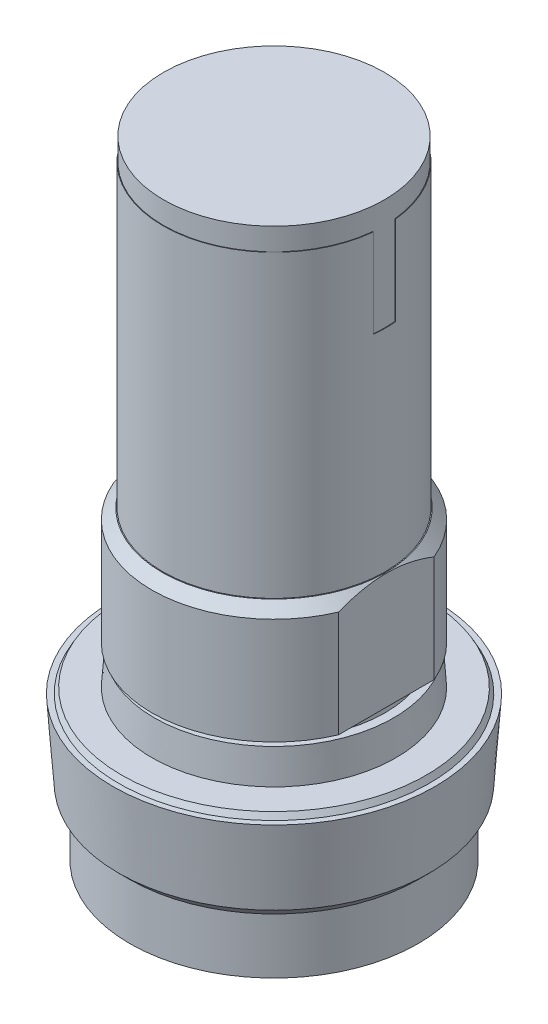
ISO-10303-21;
HEADER;
FILE_DESCRIPTION(('STEP AP214'),'2;1');
FILE_NAME('part.step','',(''),(''),'','','');
FILE_SCHEMA(('AUTOMOTIVE_DESIGN { 1 0 10303 214 1 1 1 1 }'));
ENDSEC;
DATA;
#1=APPLICATION_CONTEXT('core data for automotive mechanical design processes');
#2=APPLICATION_PROTOCOL_DEFINITION('international standard','automotive_design',2000,#1);
#3=PRODUCT_CONTEXT('',#1,'mechanical');
#4=PRODUCT('Part','Part','',(#3));
#5=PRODUCT_RELATED_PRODUCT_CATEGORY('part','',(#4));
#6=PRODUCT_DEFINITION_FORMATION('','',#4);
#7=PRODUCT_DEFINITION_CONTEXT('part definition',#1,'design');
#8=PRODUCT_DEFINITION('design','',#6,#7);
#9=PRODUCT_DEFINITION_SHAPE('','',#8);
#10=(LENGTH_UNIT() NAMED_UNIT(*) SI_UNIT(.MILLI.,.METRE.));
#11=(NAMED_UNIT(*) PLANE_ANGLE_UNIT() SI_UNIT($,.RADIAN.));
#12=(NAMED_UNIT(*) SI_UNIT($,.STERADIAN.) SOLID_ANGLE_UNIT());
#13=UNCERTAINTY_MEASURE_WITH_UNIT(LENGTH_MEASURE(1.E-05),#10,'distance_accuracy_value','');
#14=(GEOMETRIC_REPRESENTATION_CONTEXT(3) GLOBAL_UNCERTAINTY_ASSIGNED_CONTEXT((#13)) GLOBAL_UNIT_ASSIGNED_CONTEXT((#10,
#11,#12)) REPRESENTATION_CONTEXT('',''));
#15=CARTESIAN_POINT('',(0.,0.,0.));
#16=DIRECTION('',(0.,0.,1.));
#17=DIRECTION('',(1.,0.,0.));
#18=AXIS2_PLACEMENT_3D('',#15,#16,#17);
#19=CARTESIAN_POINT('',(0.,-14.,5.));
#20=DIRECTION('',(0.,-1.,0.));
#21=DIRECTION('',(1.,0.,0.));
#22=AXIS2_PLACEMENT_3D('',#19,#20,#21);
#23=PLANE('',#22);
#24=CARTESIAN_POINT('',(0.,-14.,0.));
#25=DIRECTION('',(0.,1.,0.));
#26=DIRECTION('',(0.,0.,1.));
#27=AXIS2_PLACEMENT_3D('',#24,#25,#26);
#28=CIRCLE('',#27,10.);
#29=CARTESIAN_POINT('',(0.,-14.,10.));
#30=VERTEX_POINT('',#29);
#31=EDGE_CURVE('E11',#30,#30,#28,.T.);
#32=ORIENTED_EDGE('',*,*,#31,.F.);
#33=EDGE_LOOP('',(#32));
#34=FACE_BOUND('',#33,.T.);
#35=ADVANCED_FACE('F16',(#34),#23,.T.);
#36=CARTESIAN_POINT('',(0.,-13.75,0.));
#37=DIRECTION('',(0.,1.,0.));
#38=DIRECTION('',(0.,0.,1.));
#39=AXIS2_PLACEMENT_3D('',#36,#37,#38);
#40=CONICAL_SURFACE('',#39,11.5,1.40564764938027);
#41=ORIENTED_EDGE('',*,*,#31,.T.);
#42=EDGE_LOOP('',(#41));
#43=FACE_BOUND('',#42,.T.);
#44=CARTESIAN_POINT('',(0.,-13.5,0.));
#45=DIRECTION('',(0.,1.,0.));
#46=DIRECTION('',(0.,0.,1.));
#47=AXIS2_PLACEMENT_3D('',#44,#45,#46);
#48=CIRCLE('',#47,13.);
#49=CARTESIAN_POINT('',(0.,-13.5,13.));
#50=VERTEX_POINT('',#49);
#51=EDGE_CURVE('E26',#50,#50,#48,.T.);
#52=ORIENTED_EDGE('',*,*,#51,.F.);
#53=EDGE_LOOP('',(#52));
#54=FACE_BOUND('',#53,.T.);
#55=ADVANCED_FACE('F213',(#43,#54),#40,.T.);
#56=CARTESIAN_POINT('',(0.,-11.,0.));
#57=DIRECTION('',(0.,1.,0.));
#58=DIRECTION('',(0.,0.,1.));
#59=AXIS2_PLACEMENT_3D('',#56,#57,#58);
#60=CYLINDRICAL_SURFACE('',#59,13.);
#61=ORIENTED_EDGE('',*,*,#51,.T.);
#62=EDGE_LOOP('',(#61));
#63=FACE_BOUND('',#62,.T.);
#64=CARTESIAN_POINT('',(0.,-8.5,0.));
#65=DIRECTION('',(0.,1.,0.));
#66=DIRECTION('',(0.,0.,1.));
#67=AXIS2_PLACEMENT_3D('',#64,#65,#66);
#68=CIRCLE('',#67,13.);
#69=CARTESIAN_POINT('',(0.,-8.5,13.));
#70=VERTEX_POINT('',#69);
#71=EDGE_CURVE('E565',#70,#70,#68,.T.);
#72=ORIENTED_EDGE('',*,*,#71,.F.);
#73=EDGE_LOOP('',(#72));
#74=FACE_BOUND('',#73,.T.);
#75=ADVANCED_FACE('F221',(#63,#74),#60,.T.);
#76=CARTESIAN_POINT('',(0.,-8.,0.));
#77=DIRECTION('',(0.,1.,0.));
#78=DIRECTION('',(0.,0.,1.));
#79=AXIS2_PLACEMENT_3D('',#76,#77,#78);
#80=CONICAL_SURFACE('',#79,13.5,0.785398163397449);
#81=ORIENTED_EDGE('',*,*,#71,.T.);
#82=EDGE_LOOP('',(#81));
#83=FACE_BOUND('',#82,.T.);
#84=CARTESIAN_POINT('',(0.,-7.5,0.));
#85=DIRECTION('',(0.,1.,0.));
#86=DIRECTION('',(0.,0.,1.));
#87=AXIS2_PLACEMENT_3D('',#84,#85,#86);
#88=CIRCLE('',#87,14.);
#89=CARTESIAN_POINT('',(0.,-7.5,14.));
#90=VERTEX_POINT('',#89);
#91=EDGE_CURVE('E560',#90,#90,#88,.T.);
#92=ORIENTED_EDGE('',*,*,#91,.F.);
#93=EDGE_LOOP('',(#92));
#94=FACE_BOUND('',#93,.T.);
#95=ADVANCED_FACE('F228',(#83,#94),#80,.T.);
#96=CARTESIAN_POINT('',(0.,-4.,0.));
#97=DIRECTION('',(0.,1.,0.));
#98=DIRECTION('',(0.,0.,1.));
#99=AXIS2_PLACEMENT_3D('',#96,#97,#98);
#100=CONICAL_SURFACE('',#99,14.25,0.0713074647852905);
#101=ORIENTED_EDGE('',*,*,#91,.T.);
#102=EDGE_LOOP('',(#101));
#103=FACE_BOUND('',#102,.T.);
#104=CARTESIAN_POINT('',(0.,-0.5,0.));
#105=DIRECTION('',(0.,1.,0.));
#106=DIRECTION('',(0.,0.,1.));
#107=AXIS2_PLACEMENT_3D('',#104,#105,#106);
#108=CIRCLE('',#107,14.5);
#109=CARTESIAN_POINT('',(0.,-0.500000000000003,14.5));
#110=VERTEX_POINT('',#109);
#111=EDGE_CURVE('E556',#110,#110,#108,.T.);
#112=ORIENTED_EDGE('',*,*,#111,.F.);
#113=EDGE_LOOP('',(#112));
#114=FACE_BOUND('',#113,.T.);
#115=ADVANCED_FACE('F232',(#103,#114),#100,.T.);
#116=CARTESIAN_POINT('',(0.,-0.500000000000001,7.25));
#117=DIRECTION('',(0.,1.,0.));
#118=DIRECTION('',(1.,0.,0.));
#119=AXIS2_PLACEMENT_3D('',#116,#117,#118);
#120=PLANE('',#119);
#121=CARTESIAN_POINT('',(0.,-0.500000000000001,0.));
#122=DIRECTION('',(0.,-1.,0.));
#123=DIRECTION('',(0.,0.,-1.));
#124=AXIS2_PLACEMENT_3D('',#121,#122,#123);
#125=CIRCLE('',#124,14.);
#126=CARTESIAN_POINT('',(0.,-0.5,-14.));
#127=VERTEX_POINT('',#126);
#128=EDGE_CURVE('E557',#127,#127,#125,.T.);
#129=ORIENTED_EDGE('',*,*,#128,.T.);
#130=EDGE_LOOP('',(#129));
#131=FACE_BOUND('',#130,.T.);
#132=ORIENTED_EDGE('',*,*,#111,.T.);
#133=EDGE_LOOP('',(#132));
#134=FACE_BOUND('',#133,.T.);
#135=ADVANCED_FACE('F236',(#131,#134),#120,.T.);
#136=CARTESIAN_POINT('',(0.,-0.25,0.));
#137=DIRECTION('',(0.,-1.,0.));
#138=DIRECTION('',(0.,0.,-1.));
#139=AXIS2_PLACEMENT_3D('',#136,#137,#138);
#140=CONICAL_SURFACE('',#139,13.86,0.510488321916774);
#141=CARTESIAN_POINT('',(0.,0.,0.));
#142=DIRECTION('',(0.,-1.,0.));
#143=DIRECTION('',(0.,0.,-1.));
#144=AXIS2_PLACEMENT_3D('',#141,#142,#143);
#145=CIRCLE('',#144,13.72);
#146=CARTESIAN_POINT('',(0.,0.,-13.72));
#147=VERTEX_POINT('',#146);
#148=EDGE_CURVE('E553',#147,#147,#145,.T.);
#149=ORIENTED_EDGE('',*,*,#148,.T.);
#150=EDGE_LOOP('',(#149));
#151=FACE_BOUND('',#150,.T.);
#152=ORIENTED_EDGE('',*,*,#128,.F.);
#153=EDGE_LOOP('',(#152));
#154=FACE_BOUND('',#153,.T.);
#155=ADVANCED_FACE('F240',(#151,#154),#140,.T.);
#156=CARTESIAN_POINT('',(0.,0.,-6.86));
#157=DIRECTION('',(0.,1.,0.));
#158=DIRECTION('',(1.,0.,0.));
#159=AXIS2_PLACEMENT_3D('',#156,#157,#158);
#160=PLANE('',#159);
#161=CARTESIAN_POINT('',(0.,0.,0.));
#162=DIRECTION('',(0.,-1.,0.));
#163=DIRECTION('',(0.,0.,-1.));
#164=AXIS2_PLACEMENT_3D('',#161,#162,#163);
#165=CIRCLE('',#164,11.);
#166=CARTESIAN_POINT('',(0.,0.,-11.));
#167=VERTEX_POINT('',#166);
#168=EDGE_CURVE('E550',#167,#167,#165,.T.);
#169=ORIENTED_EDGE('',*,*,#168,.T.);
#170=EDGE_LOOP('',(#169));
#171=FACE_BOUND('',#170,.T.);
#172=ORIENTED_EDGE('',*,*,#148,.F.);
#173=EDGE_LOOP('',(#172));
#174=FACE_BOUND('',#173,.T.);
#175=ADVANCED_FACE('F244',(#171,#174),#160,.T.);
#176=CARTESIAN_POINT('',(0.,1.5,0.));
#177=DIRECTION('',(0.,-1.,0.));
#178=DIRECTION('',(0.,0.,-1.));
#179=AXIS2_PLACEMENT_3D('',#176,#177,#178);
#180=CONICAL_SURFACE('',#179,10.89,0.0732022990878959);
#181=CARTESIAN_POINT('',(0.,3.,0.));
#182=DIRECTION('',(0.,-1.,0.));
#183=DIRECTION('',(0.,0.,-1.));
#184=AXIS2_PLACEMENT_3D('',#181,#182,#183);
#185=CIRCLE('',#184,10.78);
#186=CARTESIAN_POINT('',(0.,3.,-10.78));
#187=VERTEX_POINT('',#186);
#188=EDGE_CURVE('E547',#187,#187,#185,.T.);
#189=ORIENTED_EDGE('',*,*,#188,.T.);
#190=EDGE_LOOP('',(#189));
#191=FACE_BOUND('',#190,.T.);
#192=ORIENTED_EDGE('',*,*,#168,.F.);
#193=EDGE_LOOP('',(#192));
#194=FACE_BOUND('',#193,.T.);
#195=ADVANCED_FACE('F248',(#191,#194),#180,.T.);
#196=CARTESIAN_POINT('',(0.,3.,-5.39));
#197=DIRECTION('',(0.,1.,0.));
#198=DIRECTION('',(1.,0.,0.));
#199=AXIS2_PLACEMENT_3D('',#196,#197,#198);
#200=PLANE('',#199);
#201=CARTESIAN_POINT('',(0.,3.,0.));
#202=DIRECTION('',(0.,-1.,0.));
#203=DIRECTION('',(0.,0.,-1.));
#204=AXIS2_PLACEMENT_3D('',#201,#202,#203);
#205=CIRCLE('',#204,10.);
#206=CARTESIAN_POINT('',(0.,3.,-10.));
#207=VERTEX_POINT('',#206);
#208=EDGE_CURVE('E544',#207,#207,#205,.T.);
#209=ORIENTED_EDGE('',*,*,#208,.T.);
#210=EDGE_LOOP('',(#209));
#211=FACE_BOUND('',#210,.T.);
#212=ORIENTED_EDGE('',*,*,#188,.F.);
#213=EDGE_LOOP('',(#212));
#214=FACE_BOUND('',#213,.T.);
#215=ADVANCED_FACE('F252',(#211,#214),#200,.T.);
#216=CARTESIAN_POINT('',(0.,3.25,0.));
#217=DIRECTION('',(0.,-1.,0.));
#218=DIRECTION('',(0.,0.,-1.));
#219=AXIS2_PLACEMENT_3D('',#216,#217,#218);
#220=CYLINDRICAL_SURFACE('',#219,10.);
#221=CARTESIAN_POINT('',(0.,3.5,0.));
#222=DIRECTION('',(0.,1.,0.));
#223=DIRECTION('',(0.,0.,-1.));
#224=AXIS2_PLACEMENT_3D('',#221,#222,#223);
#225=CIRCLE('',#224,10.);
#226=CARTESIAN_POINT('',(0.,3.5,-10.));
#227=VERTEX_POINT('',#226);
#228=EDGE_CURVE('E541',#227,#227,#225,.T.);
#229=ORIENTED_EDGE('',*,*,#228,.F.);
#230=EDGE_LOOP('',(#229));
#231=FACE_BOUND('',#230,.T.);
#232=ORIENTED_EDGE('',*,*,#208,.F.);
#233=EDGE_LOOP('',(#232));
#234=FACE_BOUND('',#233,.T.);
#235=ADVANCED_FACE('F256',(#231,#234),#220,.T.);
#236=CARTESIAN_POINT('',(0.,3.5,-5.5));
#237=DIRECTION('',(0.,-1.,0.));
#238=DIRECTION('',(1.,0.,0.));
#239=AXIS2_PLACEMENT_3D('',#236,#237,#238);
#240=PLANE('',#239);
#241=ORIENTED_EDGE('',*,*,#228,.T.);
#242=EDGE_LOOP('',(#241));
#243=FACE_BOUND('',#242,.T.);
#244=DIRECTION('',(0.,0.,1.));
#245=VECTOR('',#244,1.);
#246=CARTESIAN_POINT('',(10.12,3.5,-2.75));
#247=LINE('',#246,#245);
#248=CARTESIAN_POINT('',(10.12,3.5,-4.31110194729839));
#249=VERTEX_POINT('',#248);
#250=CARTESIAN_POINT('',(10.12,3.5,4.31110194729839));
#251=VERTEX_POINT('',#250);
#252=EDGE_CURVE('E539',#249,#251,#247,.T.);
#253=ORIENTED_EDGE('',*,*,#252,.T.);
#254=CARTESIAN_POINT('',(0.,3.5,0.));
#255=DIRECTION('',(0.,-1.,0.));
#256=DIRECTION('',(0.,0.,-1.));
#257=AXIS2_PLACEMENT_3D('',#254,#255,#256);
#258=CIRCLE('',#257,11.);
#259=CARTESIAN_POINT('',(-10.12,3.5,4.31110194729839));
#260=VERTEX_POINT('',#259);
#261=EDGE_CURVE('E35',#251,#260,#258,.T.);
#262=ORIENTED_EDGE('',*,*,#261,.T.);
#263=DIRECTION('',(0.,0.,-1.));
#264=VECTOR('',#263,1.);
#265=CARTESIAN_POINT('',(-10.12,3.5,-2.75));
#266=LINE('',#265,#264);
#267=CARTESIAN_POINT('',(-10.12,3.5,-4.31110194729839));
#268=VERTEX_POINT('',#267);
#269=EDGE_CURVE('E535',#260,#268,#266,.T.);
#270=ORIENTED_EDGE('',*,*,#269,.T.);
#271=CARTESIAN_POINT('',(0.,3.5,0.));
#272=DIRECTION('',(0.,-1.,0.));
#273=DIRECTION('',(0.,0.,-1.));
#274=AXIS2_PLACEMENT_3D('',#271,#272,#273);
#275=CIRCLE('',#274,11.);
#276=EDGE_CURVE('E532',#268,#249,#275,.T.);
#277=ORIENTED_EDGE('',*,*,#276,.T.);
#278=EDGE_LOOP('',(#253,#262,#270,#277));
#279=FACE_BOUND('',#278,.T.);
#280=ADVANCED_FACE('F260',(#243,#279),#240,.T.);
#281=CARTESIAN_POINT('',(0.,8.29,0.));
#282=DIRECTION('',(0.,-1.,0.));
#283=DIRECTION('',(0.,0.,-1.));
#284=AXIS2_PLACEMENT_3D('',#281,#282,#283);
#285=CYLINDRICAL_SURFACE('',#284,11.);
#286=DIRECTION('',(0.,-1.,0.));
#287=VECTOR('',#286,1.);
#288=CARTESIAN_POINT('',(-10.12,8.29,4.31110194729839));
#289=LINE('',#288,#287);
#290=CARTESIAN_POINT('',(-10.12,13.08,4.31110194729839));
#291=VERTEX_POINT('',#290);
#292=EDGE_CURVE('E521',#291,#260,#289,.T.);
#293=ORIENTED_EDGE('',*,*,#292,.T.);
#294=ORIENTED_EDGE('',*,*,#261,.F.);
#295=DIRECTION('',(0.,1.,0.));
#296=VECTOR('',#295,1.);
#297=CARTESIAN_POINT('',(10.12,8.29,4.31110194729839));
#298=LINE('',#297,#296);
#299=CARTESIAN_POINT('',(10.12,13.08,4.31110194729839));
#300=VERTEX_POINT('',#299);
#301=EDGE_CURVE('E497',#251,#300,#298,.T.);
#302=ORIENTED_EDGE('',*,*,#301,.T.);
#303=CARTESIAN_POINT('',(0.,13.08,0.));
#304=DIRECTION('',(0.,-1.,0.));
#305=DIRECTION('',(0.,0.,-1.));
#306=AXIS2_PLACEMENT_3D('',#303,#304,#305);
#307=CIRCLE('',#306,11.);
#308=EDGE_CURVE('E530',#300,#291,#307,.T.);
#309=ORIENTED_EDGE('',*,*,#308,.T.);
#310=EDGE_LOOP('',(#293,#294,#302,#309));
#311=FACE_BOUND('',#310,.T.);
#312=ADVANCED_FACE('F264',(#311),#285,.T.);
#313=CARTESIAN_POINT('',(-10.12,8.75,0.));
#314=DIRECTION('',(-1.,0.,0.));
#315=DIRECTION('',(0.,1.,0.));
#316=AXIS2_PLACEMENT_3D('',#313,#314,#315);
#317=PLANE('',#316);
#318=ORIENTED_EDGE('',*,*,#292,.F.);
#319=CARTESIAN_POINT('',(-10.12,13.08,-4.31110194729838));
#320=CARTESIAN_POINT('',(-10.12,14.7696,0.));
#321=CARTESIAN_POINT('',(-10.12,13.08,4.31110194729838));
#322=(BOUNDED_CURVE() B_SPLINE_CURVE(2,(#319,#320,#321),.UNSPECIFIED.,.F.,
.F.) B_SPLINE_CURVE_WITH_KNOTS((3,3),(0.,0.346456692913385),
.UNSPECIFIED.) CURVE() GEOMETRIC_REPRESENTATION_ITEM() RATIONAL_B_SPLINE_CURVE((1.,
1.08695652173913,1.)) REPRESENTATION_ITEM(''));
#323=CARTESIAN_POINT('',(-10.12,13.08,-4.31110194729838));
#324=VERTEX_POINT('',#323);
#325=EDGE_CURVE('E494',#324,#291,#322,.T.);
#326=ORIENTED_EDGE('',*,*,#325,.F.);
#327=DIRECTION('',(0.,1.,0.));
#328=VECTOR('',#327,1.);
#329=CARTESIAN_POINT('',(-10.12,8.29,-4.31110194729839));
#330=LINE('',#329,#328);
#331=EDGE_CURVE('E519',#268,#324,#330,.T.);
#332=ORIENTED_EDGE('',*,*,#331,.F.);
#333=ORIENTED_EDGE('',*,*,#269,.F.);
#334=EDGE_LOOP('',(#318,#326,#332,#333));
#335=FACE_BOUND('',#334,.T.);
#336=ADVANCED_FACE('F268',(#335),#317,.T.);
#337=CARTESIAN_POINT('',(0.,8.29,0.));
#338=DIRECTION('',(0.,-1.,0.));
#339=DIRECTION('',(0.,0.,-1.));
#340=AXIS2_PLACEMENT_3D('',#337,#338,#339);
#341=CYLINDRICAL_SURFACE('',#340,11.);
#342=CARTESIAN_POINT('',(0.,13.08,0.));
#343=DIRECTION('',(0.,-1.,0.));
#344=DIRECTION('',(0.,0.,-1.));
#345=AXIS2_PLACEMENT_3D('',#342,#343,#344);
#346=CIRCLE('',#345,11.);
#347=CARTESIAN_POINT('',(10.12,13.08,-4.31110194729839));
#348=VERTEX_POINT('',#347);
#349=EDGE_CURVE('E517',#324,#348,#346,.T.);
#350=ORIENTED_EDGE('',*,*,#349,.T.);
#351=DIRECTION('',(0.,-1.,0.));
#352=VECTOR('',#351,1.);
#353=CARTESIAN_POINT('',(10.12,8.29,-4.31110194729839));
#354=LINE('',#353,#352);
#355=EDGE_CURVE('E509',#348,#249,#354,.T.);
#356=ORIENTED_EDGE('',*,*,#355,.T.);
#357=ORIENTED_EDGE('',*,*,#276,.F.);
#358=ORIENTED_EDGE('',*,*,#331,.T.);
#359=EDGE_LOOP('',(#350,#356,#357,#358));
#360=FACE_BOUND('',#359,.T.);
#361=ADVANCED_FACE('F271',(#360),#341,.T.);
#362=CARTESIAN_POINT('',(10.12,8.75,0.));
#363=DIRECTION('',(1.,0.,0.));
#364=DIRECTION('',(0.,1.,0.));
#365=AXIS2_PLACEMENT_3D('',#362,#363,#364);
#366=PLANE('',#365);
#367=ORIENTED_EDGE('',*,*,#355,.F.);
#368=CARTESIAN_POINT('',(10.12,13.08,4.31110194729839));
#369=CARTESIAN_POINT('',(10.12,14.7696,0.));
#370=CARTESIAN_POINT('',(10.12,13.08,-4.31110194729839));
#371=(BOUNDED_CURVE() B_SPLINE_CURVE(2,(#368,#369,#370),.UNSPECIFIED.,.F.,
.F.) B_SPLINE_CURVE_WITH_KNOTS((3,3),(0.,0.346456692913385),
.UNSPECIFIED.) CURVE() GEOMETRIC_REPRESENTATION_ITEM() RATIONAL_B_SPLINE_CURVE((1.,
1.08695652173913,1.)) REPRESENTATION_ITEM(''));
#372=EDGE_CURVE('E495',#300,#348,#371,.T.);
#373=ORIENTED_EDGE('',*,*,#372,.F.);
#374=ORIENTED_EDGE('',*,*,#301,.F.);
#375=ORIENTED_EDGE('',*,*,#252,.F.);
#376=EDGE_LOOP('',(#367,#373,#374,#375));
#377=FACE_BOUND('',#376,.T.);
#378=ADVANCED_FACE('F275',(#377),#366,.T.);
#379=CARTESIAN_POINT('',(0.,43.,-4.975));
#380=DIRECTION('',(0.,1.,0.));
#381=DIRECTION('',(1.,0.,0.));
#382=AXIS2_PLACEMENT_3D('',#379,#380,#381);
#383=PLANE('',#382);
#384=CARTESIAN_POINT('',(0.,43.,0.));
#385=DIRECTION('',(0.,-1.,0.));
#386=DIRECTION('',(0.,0.,-1.));
#387=AXIS2_PLACEMENT_3D('',#384,#385,#386);
#388=CIRCLE('',#387,9.95);
#389=CARTESIAN_POINT('',(0.,43.,-9.95));
#390=VERTEX_POINT('',#389);
#391=EDGE_CURVE('E176',#390,#390,#388,.T.);
#392=ORIENTED_EDGE('',*,*,#391,.F.);
#393=EDGE_LOOP('',(#392));
#394=FACE_BOUND('',#393,.T.);
#395=ADVANCED_FACE('F279',(#394),#383,.T.);
#396=CARTESIAN_POINT('',(0.,13.54,0.));
#397=DIRECTION('',(0.,-1.,0.));
#398=DIRECTION('',(0.,0.,-1.));
#399=AXIS2_PLACEMENT_3D('',#396,#397,#398);
#400=CONICAL_SURFACE('',#399,10.54,0.785398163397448);
#401=CARTESIAN_POINT('',(0.,14.,0.));
#402=DIRECTION('',(0.,-1.,0.));
#403=DIRECTION('',(0.,0.,-1.));
#404=AXIS2_PLACEMENT_3D('',#401,#402,#403);
#405=CIRCLE('',#404,10.08);
#406=CARTESIAN_POINT('',(0.,14.,-10.08));
#407=VERTEX_POINT('',#406);
#408=EDGE_CURVE('E196',#407,#407,#405,.T.);
#409=ORIENTED_EDGE('',*,*,#408,.T.);
#410=EDGE_LOOP('',(#409));
#411=FACE_BOUND('',#410,.T.);
#412=ORIENTED_EDGE('',*,*,#308,.F.);
#413=ORIENTED_EDGE('',*,*,#372,.T.);
#414=ORIENTED_EDGE('',*,*,#349,.F.);
#415=ORIENTED_EDGE('',*,*,#325,.T.);
#416=EDGE_LOOP('',(#412,#413,#414,#415));
#417=FACE_BOUND('',#416,.T.);
#418=ADVANCED_FACE('F283',(#411,#417),#400,.T.);
#419=CARTESIAN_POINT('',(0.,28.5,0.));
#420=DIRECTION('',(0.,-1.,0.));
#421=DIRECTION('',(0.,0.,-1.));
#422=AXIS2_PLACEMENT_3D('',#419,#420,#421);
#423=CYLINDRICAL_SURFACE('',#422,9.95);
#424=ORIENTED_EDGE('',*,*,#391,.T.);
#425=EDGE_LOOP('',(#424));
#426=FACE_BOUND('',#425,.T.);
#427=CARTESIAN_POINT('',(0.,41.,0.));
#428=DIRECTION('',(0.,-1.,0.));
#429=DIRECTION('',(0.,0.,-1.));
#430=AXIS2_PLACEMENT_3D('',#427,#428,#429);
#431=CIRCLE('',#430,9.95);
#432=CARTESIAN_POINT('',(-9.89962120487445,41.,-1.));
#433=VERTEX_POINT('',#432);
#434=CARTESIAN_POINT('',(9.89962120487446,41.,-1.));
#435=VERTEX_POINT('',#434);
#436=EDGE_CURVE('E121',#433,#435,#431,.T.);
#437=ORIENTED_EDGE('',*,*,#436,.F.);
#438=DIRECTION('',(0.,1.,0.));
#439=VECTOR('',#438,1.);
#440=CARTESIAN_POINT('',(-9.89962120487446,28.5,-1.));
#441=LINE('',#440,#439);
#442=CARTESIAN_POINT('',(-9.89962120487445,33.,-1.));
#443=VERTEX_POINT('',#442);
#444=EDGE_CURVE('E173',#443,#433,#441,.T.);
#445=ORIENTED_EDGE('',*,*,#444,.F.);
#446=CARTESIAN_POINT('',(0.,33.,0.));
#447=DIRECTION('',(0.,-1.,0.));
#448=DIRECTION('',(0.,0.,-1.));
#449=AXIS2_PLACEMENT_3D('',#446,#447,#448);
#450=CIRCLE('',#449,9.95);
#451=CARTESIAN_POINT('',(-9.89962120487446,33.,1.));
#452=VERTEX_POINT('',#451);
#453=EDGE_CURVE('E138',#452,#443,#450,.T.);
#454=ORIENTED_EDGE('',*,*,#453,.F.);
#455=DIRECTION('',(0.,-1.,0.));
#456=VECTOR('',#455,1.);
#457=CARTESIAN_POINT('',(-9.89962120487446,28.5,1.));
#458=LINE('',#457,#456);
#459=CARTESIAN_POINT('',(-9.89962120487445,41.,1.));
#460=VERTEX_POINT('',#459);
#461=EDGE_CURVE('E143',#460,#452,#458,.T.);
#462=ORIENTED_EDGE('',*,*,#461,.F.);
#463=CARTESIAN_POINT('',(0.,41.,0.));
#464=DIRECTION('',(0.,-1.,0.));
#465=DIRECTION('',(0.,0.,-1.));
#466=AXIS2_PLACEMENT_3D('',#463,#464,#465);
#467=CIRCLE('',#466,9.95);
#468=CARTESIAN_POINT('',(9.89962120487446,41.,1.));
#469=VERTEX_POINT('',#468);
#470=EDGE_CURVE('E150',#469,#460,#467,.T.);
#471=ORIENTED_EDGE('',*,*,#470,.F.);
#472=DIRECTION('',(0.,1.,0.));
#473=VECTOR('',#472,1.);
#474=CARTESIAN_POINT('',(9.89962120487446,28.5,1.));
#475=LINE('',#474,#473);
#476=CARTESIAN_POINT('',(9.89962120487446,33.,1.));
#477=VERTEX_POINT('',#476);
#478=EDGE_CURVE('E159',#477,#469,#475,.T.);
#479=ORIENTED_EDGE('',*,*,#478,.F.);
#480=CARTESIAN_POINT('',(0.,33.,0.));
#481=DIRECTION('',(0.,-1.,0.));
#482=DIRECTION('',(0.,0.,-1.));
#483=AXIS2_PLACEMENT_3D('',#480,#481,#482);
#484=CIRCLE('',#483,9.95);
#485=CARTESIAN_POINT('',(9.89962120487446,33.,-1.));
#486=VERTEX_POINT('',#485);
#487=EDGE_CURVE('E164',#486,#477,#484,.T.);
#488=ORIENTED_EDGE('',*,*,#487,.F.);
#489=DIRECTION('',(0.,-1.,0.));
#490=VECTOR('',#489,1.);
#491=CARTESIAN_POINT('',(9.89962120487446,28.5,-1.));
#492=LINE('',#491,#490);
#493=EDGE_CURVE('E166',#435,#486,#492,.T.);
#494=ORIENTED_EDGE('',*,*,#493,.F.);
#495=EDGE_LOOP('',(#437,#445,#454,#462,#471,#479,#488,#494));
#496=FACE_BOUND('',#495,.T.);
#497=ADVANCED_FACE('F186',(#426,#496),#423,.T.);
#498=CARTESIAN_POINT('',(0.,38.,-1.));
#499=DIRECTION('',(0.,0.,1.));
#500=DIRECTION('',(1.,0.,0.));
#501=AXIS2_PLACEMENT_3D('',#498,#499,#500);
#502=PLANE('',#501);
#503=ORIENTED_EDGE('',*,*,#444,.T.);
#504=DIRECTION('',(1.,0.,0.));
#505=VECTOR('',#504,1.);
#506=CARTESIAN_POINT('',(0.,41.,-1.));
#507=LINE('',#506,#505);
#508=CARTESIAN_POINT('',(-9.94987437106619,41.,-1.));
#509=VERTEX_POINT('',#508);
#510=EDGE_CURVE('E123',#509,#433,#507,.T.);
#511=ORIENTED_EDGE('',*,*,#510,.F.);
#512=DIRECTION('',(0.,1.,0.));
#513=VECTOR('',#512,1.);
#514=CARTESIAN_POINT('',(-9.9498743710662,27.5,-1.));
#515=LINE('',#514,#513);
#516=CARTESIAN_POINT('',(-9.9498743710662,33.,-1.));
#517=VERTEX_POINT('',#516);
#518=EDGE_CURVE('E127',#517,#509,#515,.T.);
#519=ORIENTED_EDGE('',*,*,#518,.F.);
#520=DIRECTION('',(-1.,0.,0.));
#521=VECTOR('',#520,1.);
#522=CARTESIAN_POINT('',(0.,33.,-1.));
#523=LINE('',#522,#521);
#524=EDGE_CURVE('E136',#443,#517,#523,.T.);
#525=ORIENTED_EDGE('',*,*,#524,.F.);
#526=EDGE_LOOP('',(#503,#511,#519,#525));
#527=FACE_BOUND('',#526,.T.);
#528=ADVANCED_FACE('F290',(#527),#502,.T.);
#529=CARTESIAN_POINT('',(0.,33.,0.));
#530=DIRECTION('',(0.,1.,0.));
#531=DIRECTION('',(1.,0.,0.));
#532=AXIS2_PLACEMENT_3D('',#529,#530,#531);
#533=PLANE('',#532);
#534=ORIENTED_EDGE('',*,*,#453,.T.);
#535=ORIENTED_EDGE('',*,*,#524,.T.);
#536=CARTESIAN_POINT('',(0.,33.,0.));
#537=DIRECTION('',(0.,-1.,0.));
#538=DIRECTION('',(0.,0.,-1.));
#539=AXIS2_PLACEMENT_3D('',#536,#537,#538);
#540=CIRCLE('',#539,10.);
#541=CARTESIAN_POINT('',(-9.9498743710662,33.,1.));
#542=VERTEX_POINT('',#541);
#543=EDGE_CURVE('E129',#542,#517,#540,.T.);
#544=ORIENTED_EDGE('',*,*,#543,.F.);
#545=DIRECTION('',(1.,0.,0.));
#546=VECTOR('',#545,1.);
#547=CARTESIAN_POINT('',(0.,33.,1.));
#548=LINE('',#547,#546);
#549=EDGE_CURVE('E139',#542,#452,#548,.T.);
#550=ORIENTED_EDGE('',*,*,#549,.T.);
#551=EDGE_LOOP('',(#534,#535,#544,#550));
#552=FACE_BOUND('',#551,.T.);
#553=ADVANCED_FACE('F189',(#552),#533,.T.);
#554=CARTESIAN_POINT('',(0.,38.,1.));
#555=DIRECTION('',(0.,0.,1.));
#556=DIRECTION('',(1.,0.,0.));
#557=AXIS2_PLACEMENT_3D('',#554,#555,#556);
#558=PLANE('',#557);
#559=ORIENTED_EDGE('',*,*,#461,.T.);
#560=ORIENTED_EDGE('',*,*,#549,.F.);
#561=DIRECTION('',(0.,-1.,0.));
#562=VECTOR('',#561,1.);
#563=CARTESIAN_POINT('',(-9.9498743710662,27.5,1.));
#564=LINE('',#563,#562);
#565=CARTESIAN_POINT('',(-9.9498743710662,41.,1.));
#566=VERTEX_POINT('',#565);
#567=EDGE_CURVE('E131',#566,#542,#564,.T.);
#568=ORIENTED_EDGE('',*,*,#567,.F.);
#569=DIRECTION('',(-1.,0.,0.));
#570=VECTOR('',#569,1.);
#571=CARTESIAN_POINT('',(0.,41.,1.));
#572=LINE('',#571,#570);
#573=EDGE_CURVE('E147',#460,#566,#572,.T.);
#574=ORIENTED_EDGE('',*,*,#573,.F.);
#575=EDGE_LOOP('',(#559,#560,#568,#574));
#576=FACE_BOUND('',#575,.T.);
#577=ADVANCED_FACE('F182',(#576),#558,.F.);
#578=CARTESIAN_POINT('',(0.,14.,-5.04));
#579=DIRECTION('',(0.,1.,0.));
#580=DIRECTION('',(1.,0.,0.));
#581=AXIS2_PLACEMENT_3D('',#578,#579,#580);
#582=PLANE('',#581);
#583=ORIENTED_EDGE('',*,*,#408,.F.);
#584=EDGE_LOOP('',(#583));
#585=FACE_BOUND('',#584,.T.);
#586=CARTESIAN_POINT('',(0.,14.,0.));
#587=DIRECTION('',(0.,-1.,0.));
#588=DIRECTION('',(0.,0.,-1.));
#589=AXIS2_PLACEMENT_3D('',#586,#587,#588);
#590=CIRCLE('',#589,10.);
#591=CARTESIAN_POINT('',(0.,14.,-10.));
#592=VERTEX_POINT('',#591);
#593=EDGE_CURVE('E152',#592,#592,#590,.T.);
#594=ORIENTED_EDGE('',*,*,#593,.T.);
#595=EDGE_LOOP('',(#594));
#596=FACE_BOUND('',#595,.T.);
#597=ADVANCED_FACE('F210',(#585,#596),#582,.T.);
#598=CARTESIAN_POINT('',(0.,41.,-5.));
#599=DIRECTION('',(0.,1.,0.));
#600=DIRECTION('',(1.,0.,0.));
#601=AXIS2_PLACEMENT_3D('',#598,#599,#600);
#602=PLANE('',#601);
#603=ORIENTED_EDGE('',*,*,#470,.T.);
#604=ORIENTED_EDGE('',*,*,#573,.T.);
#605=CARTESIAN_POINT('',(0.,41.,0.));
#606=DIRECTION('',(0.,-1.,0.));
#607=DIRECTION('',(0.,0.,-1.));
#608=AXIS2_PLACEMENT_3D('',#605,#606,#607);
#609=CIRCLE('',#608,10.);
#610=CARTESIAN_POINT('',(9.9498743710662,41.,1.));
#611=VERTEX_POINT('',#610);
#612=EDGE_CURVE('E146',#611,#566,#609,.T.);
#613=ORIENTED_EDGE('',*,*,#612,.F.);
#614=DIRECTION('',(-1.,0.,0.));
#615=VECTOR('',#614,1.);
#616=CARTESIAN_POINT('',(0.,41.,1.));
#617=LINE('',#616,#615);
#618=EDGE_CURVE('E151',#611,#469,#617,.T.);
#619=ORIENTED_EDGE('',*,*,#618,.T.);
#620=EDGE_LOOP('',(#603,#604,#613,#619));
#621=FACE_BOUND('',#620,.T.);
#622=ADVANCED_FACE('F191',(#621),#602,.T.);
#623=CARTESIAN_POINT('',(0.,38.,1.));
#624=DIRECTION('',(0.,0.,1.));
#625=DIRECTION('',(1.,0.,0.));
#626=AXIS2_PLACEMENT_3D('',#623,#624,#625);
#627=PLANE('',#626);
#628=ORIENTED_EDGE('',*,*,#478,.T.);
#629=ORIENTED_EDGE('',*,*,#618,.F.);
#630=DIRECTION('',(0.,1.,0.));
#631=VECTOR('',#630,1.);
#632=CARTESIAN_POINT('',(9.9498743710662,27.5,1.));
#633=LINE('',#632,#631);
#634=CARTESIAN_POINT('',(9.9498743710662,33.,1.));
#635=VERTEX_POINT('',#634);
#636=EDGE_CURVE('E160',#635,#611,#633,.T.);
#637=ORIENTED_EDGE('',*,*,#636,.F.);
#638=DIRECTION('',(1.,0.,0.));
#639=VECTOR('',#638,1.);
#640=CARTESIAN_POINT('',(0.,33.,1.));
#641=LINE('',#640,#639);
#642=EDGE_CURVE('E162',#477,#635,#641,.T.);
#643=ORIENTED_EDGE('',*,*,#642,.F.);
#644=EDGE_LOOP('',(#628,#629,#637,#643));
#645=FACE_BOUND('',#644,.T.);
#646=ADVANCED_FACE('F201',(#645),#627,.F.);
#647=CARTESIAN_POINT('',(0.,33.,0.));
#648=DIRECTION('',(0.,1.,0.));
#649=DIRECTION('',(1.,0.,0.));
#650=AXIS2_PLACEMENT_3D('',#647,#648,#649);
#651=PLANE('',#650);
#652=ORIENTED_EDGE('',*,*,#487,.T.);
#653=ORIENTED_EDGE('',*,*,#642,.T.);
#654=CARTESIAN_POINT('',(0.,33.,0.));
#655=DIRECTION('',(0.,-1.,0.));
#656=DIRECTION('',(0.,0.,-1.));
#657=AXIS2_PLACEMENT_3D('',#654,#655,#656);
#658=CIRCLE('',#657,10.);
#659=CARTESIAN_POINT('',(9.9498743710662,33.,-1.));
#660=VERTEX_POINT('',#659);
#661=EDGE_CURVE('E103',#660,#635,#658,.T.);
#662=ORIENTED_EDGE('',*,*,#661,.F.);
#663=DIRECTION('',(-1.,0.,0.));
#664=VECTOR('',#663,1.);
#665=CARTESIAN_POINT('',(0.,33.,-1.));
#666=LINE('',#665,#664);
#667=EDGE_CURVE('E113',#660,#486,#666,.T.);
#668=ORIENTED_EDGE('',*,*,#667,.T.);
#669=EDGE_LOOP('',(#652,#653,#662,#668));
#670=FACE_BOUND('',#669,.T.);
#671=ADVANCED_FACE('F200',(#670),#651,.T.);
#672=CARTESIAN_POINT('',(0.,38.,-1.));
#673=DIRECTION('',(0.,0.,1.));
#674=DIRECTION('',(1.,0.,0.));
#675=AXIS2_PLACEMENT_3D('',#672,#673,#674);
#676=PLANE('',#675);
#677=ORIENTED_EDGE('',*,*,#493,.T.);
#678=ORIENTED_EDGE('',*,*,#667,.F.);
#679=DIRECTION('',(0.,-1.,0.));
#680=VECTOR('',#679,1.);
#681=CARTESIAN_POINT('',(9.9498743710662,27.5,-1.));
#682=LINE('',#681,#680);
#683=CARTESIAN_POINT('',(9.9498743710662,41.,-1.));
#684=VERTEX_POINT('',#683);
#685=EDGE_CURVE('E109',#684,#660,#682,.T.);
#686=ORIENTED_EDGE('',*,*,#685,.F.);
#687=DIRECTION('',(1.,0.,0.));
#688=VECTOR('',#687,1.);
#689=CARTESIAN_POINT('',(0.,41.,-1.));
#690=LINE('',#689,#688);
#691=EDGE_CURVE('E112',#435,#684,#690,.T.);
#692=ORIENTED_EDGE('',*,*,#691,.F.);
#693=EDGE_LOOP('',(#677,#678,#686,#692));
#694=FACE_BOUND('',#693,.T.);
#695=ADVANCED_FACE('F111',(#694),#676,.T.);
#696=CARTESIAN_POINT('',(0.,41.,-5.));
#697=DIRECTION('',(0.,1.,0.));
#698=DIRECTION('',(1.,0.,0.));
#699=AXIS2_PLACEMENT_3D('',#696,#697,#698);
#700=PLANE('',#699);
#701=ORIENTED_EDGE('',*,*,#510,.T.);
#702=ORIENTED_EDGE('',*,*,#436,.T.);
#703=ORIENTED_EDGE('',*,*,#691,.T.);
#704=CARTESIAN_POINT('',(0.,41.,0.));
#705=DIRECTION('',(0.,-1.,0.));
#706=DIRECTION('',(0.,0.,-1.));
#707=AXIS2_PLACEMENT_3D('',#704,#705,#706);
#708=CIRCLE('',#707,10.);
#709=EDGE_CURVE('E20',#509,#684,#708,.T.);
#710=ORIENTED_EDGE('',*,*,#709,.F.);
#711=EDGE_LOOP('',(#701,#702,#703,#710));
#712=FACE_BOUND('',#711,.T.);
#713=ADVANCED_FACE('F119',(#712),#700,.T.);
#714=CARTESIAN_POINT('',(0.,27.5,0.));
#715=DIRECTION('',(0.,-1.,0.));
#716=DIRECTION('',(0.,0.,-1.));
#717=AXIS2_PLACEMENT_3D('',#714,#715,#716);
#718=CYLINDRICAL_SURFACE('',#717,10.);
#719=ORIENTED_EDGE('',*,*,#636,.T.);
#720=ORIENTED_EDGE('',*,*,#612,.T.);
#721=ORIENTED_EDGE('',*,*,#567,.T.);
#722=ORIENTED_EDGE('',*,*,#543,.T.);
#723=ORIENTED_EDGE('',*,*,#518,.T.);
#724=ORIENTED_EDGE('',*,*,#709,.T.);
#725=ORIENTED_EDGE('',*,*,#685,.T.);
#726=ORIENTED_EDGE('',*,*,#661,.T.);
#727=EDGE_LOOP('',(#719,#720,#721,#722,#723,#724,#725,#726));
#728=FACE_BOUND('',#727,.T.);
#729=ORIENTED_EDGE('',*,*,#593,.F.);
#730=EDGE_LOOP('',(#729));
#731=FACE_BOUND('',#730,.T.);
#732=ADVANCED_FACE('F18',(#728,#731),#718,.T.);
#733=CLOSED_SHELL('',(#35,#55,#75,#95,#115,#135,#155,#175,#195,#215,#235,#280,#312,#336,#361,
#378,#395,#418,#497,#528,#553,#577,#597,#622,#646,#671,#695,#713,#732));
#734=MANIFOLD_SOLID_BREP('B1',#733);
#735=ADVANCED_BREP_SHAPE_REPRESENTATION('',(#18,#734),#14);
#736=SHAPE_DEFINITION_REPRESENTATION(#9,#735);
ENDSEC;
END-ISO-10303-21;
